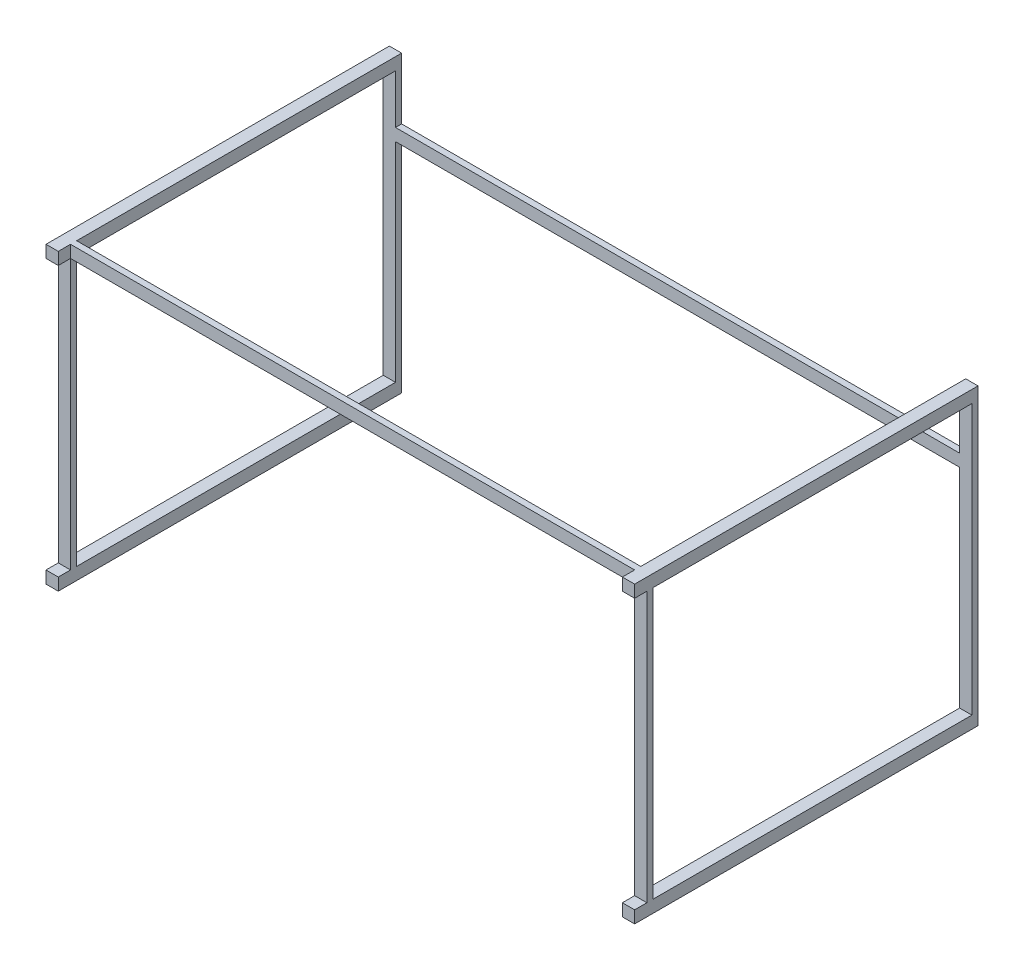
ISO-10303-21;
HEADER;
FILE_DESCRIPTION(('STEP AP214'),'2;1');
FILE_NAME('part.step','',(''),(''),'','','');
FILE_SCHEMA(('AUTOMOTIVE_DESIGN { 1 0 10303 214 1 1 1 1 }'));
ENDSEC;
DATA;
#1=APPLICATION_CONTEXT('core data for automotive mechanical design processes');
#2=APPLICATION_PROTOCOL_DEFINITION('international standard','automotive_design',2000,#1);
#3=PRODUCT_CONTEXT('',#1,'mechanical');
#4=PRODUCT('Part','Part','',(#3));
#5=PRODUCT_RELATED_PRODUCT_CATEGORY('part','',(#4));
#6=PRODUCT_DEFINITION_FORMATION('','',#4);
#7=PRODUCT_DEFINITION_CONTEXT('part definition',#1,'design');
#8=PRODUCT_DEFINITION('design','',#6,#7);
#9=PRODUCT_DEFINITION_SHAPE('','',#8);
#10=(LENGTH_UNIT() NAMED_UNIT(*) SI_UNIT(.MILLI.,.METRE.));
#11=(NAMED_UNIT(*) PLANE_ANGLE_UNIT() SI_UNIT($,.RADIAN.));
#12=(NAMED_UNIT(*) SI_UNIT($,.STERADIAN.) SOLID_ANGLE_UNIT());
#13=UNCERTAINTY_MEASURE_WITH_UNIT(LENGTH_MEASURE(1.E-05),#10,'distance_accuracy_value','');
#14=(GEOMETRIC_REPRESENTATION_CONTEXT(3) GLOBAL_UNCERTAINTY_ASSIGNED_CONTEXT((#13)) GLOBAL_UNIT_ASSIGNED_CONTEXT((#10,
#11,#12)) REPRESENTATION_CONTEXT('',''));
#15=CARTESIAN_POINT('',(0.,0.,0.));
#16=DIRECTION('',(0.,0.,1.));
#17=DIRECTION('',(1.,0.,0.));
#18=AXIS2_PLACEMENT_3D('',#15,#16,#17);
#19=CARTESIAN_POINT('',(25.4,0.,-711.2));
#20=DIRECTION('',(1.,0.,0.));
#21=DIRECTION('',(0.,0.,-1.));
#22=AXIS2_PLACEMENT_3D('',#19,#20,#21);
#23=PLANE('',#22);
#24=DIRECTION('',(0.,1.,0.));
#25=VECTOR('',#24,1.);
#26=CARTESIAN_POINT('',(25.4,0.,-711.2));
#27=LINE('',#26,#25);
#28=CARTESIAN_POINT('',(25.4,-584.2,-711.2));
#29=VERTEX_POINT('',#28);
#30=CARTESIAN_POINT('',(25.4,-127.,-711.2));
#31=VERTEX_POINT('',#30);
#32=EDGE_CURVE('E270',#29,#31,#27,.T.);
#33=ORIENTED_EDGE('',*,*,#32,.T.);
#34=DIRECTION('',(0.,0.,-1.));
#35=VECTOR('',#34,1.);
#36=CARTESIAN_POINT('',(25.4,-127.,-698.5));
#37=LINE('',#36,#35);
#38=CARTESIAN_POINT('',(25.4,-127.,-698.5));
#39=VERTEX_POINT('',#38);
#40=EDGE_CURVE('E258',#39,#31,#37,.T.);
#41=ORIENTED_EDGE('',*,*,#40,.F.);
#42=DIRECTION('',(0.,1.,0.));
#43=VECTOR('',#42,1.);
#44=CARTESIAN_POINT('',(25.4,-584.202,-698.5));
#45=LINE('',#44,#43);
#46=CARTESIAN_POINT('',(25.4,-558.8,-698.5));
#47=VERTEX_POINT('',#46);
#48=EDGE_CURVE('E268',#47,#39,#45,.T.);
#49=ORIENTED_EDGE('',*,*,#48,.F.);
#50=DIRECTION('',(0.,0.,-1.));
#51=VECTOR('',#50,1.);
#52=CARTESIAN_POINT('',(25.4,-558.8,0.));
#53=LINE('',#52,#51);
#54=CARTESIAN_POINT('',(25.4,-558.8,-38.1));
#55=VERTEX_POINT('',#54);
#56=EDGE_CURVE('E465',#55,#47,#53,.T.);
#57=ORIENTED_EDGE('',*,*,#56,.F.);
#58=DIRECTION('',(0.,1.,0.));
#59=VECTOR('',#58,1.);
#60=CARTESIAN_POINT('',(25.4,-558.8,-38.1));
#61=LINE('',#60,#59);
#62=CARTESIAN_POINT('',(25.4,0.,-38.1));
#63=VERTEX_POINT('',#62);
#64=EDGE_CURVE('E501',#55,#63,#61,.T.);
#65=ORIENTED_EDGE('',*,*,#64,.T.);
#66=DIRECTION('',(0.,0.,-1.));
#67=VECTOR('',#66,1.);
#68=CARTESIAN_POINT('',(25.4,0.,-25.4));
#69=LINE('',#68,#67);
#70=CARTESIAN_POINT('',(25.4,0.,-25.4));
#71=VERTEX_POINT('',#70);
#72=EDGE_CURVE('E419',#71,#63,#69,.T.);
#73=ORIENTED_EDGE('',*,*,#72,.F.);
#74=DIRECTION('',(0.,1.,0.));
#75=VECTOR('',#74,1.);
#76=CARTESIAN_POINT('',(25.4,-558.8,-25.4));
#77=LINE('',#76,#75);
#78=CARTESIAN_POINT('',(25.4,-558.8,-25.4));
#79=VERTEX_POINT('',#78);
#80=EDGE_CURVE('E497',#79,#71,#77,.T.);
#81=ORIENTED_EDGE('',*,*,#80,.F.);
#82=CARTESIAN_POINT('',(25.4,-558.8,0.));
#83=VERTEX_POINT('',#82);
#84=EDGE_CURVE('E466',#83,#79,#53,.T.);
#85=ORIENTED_EDGE('',*,*,#84,.F.);
#86=DIRECTION('',(0.,1.,0.));
#87=VECTOR('',#86,1.);
#88=CARTESIAN_POINT('',(25.4,-558.8,0.));
#89=LINE('',#88,#87);
#90=CARTESIAN_POINT('',(25.4,-584.2,0.));
#91=VERTEX_POINT('',#90);
#92=EDGE_CURVE('E454',#91,#83,#89,.T.);
#93=ORIENTED_EDGE('',*,*,#92,.F.);
#94=DIRECTION('',(0.,0.,-1.));
#95=VECTOR('',#94,1.);
#96=CARTESIAN_POINT('',(25.4,-584.2,0.));
#97=LINE('',#96,#95);
#98=EDGE_CURVE('E470',#91,#29,#97,.T.);
#99=ORIENTED_EDGE('',*,*,#98,.T.);
#100=EDGE_LOOP('',(#33,#41,#49,#57,#65,#73,#81,#85,#93,#99));
#101=FACE_BOUND('',#100,.T.);
#102=ADVANCED_FACE('F54',(#101),#23,.T.);
#103=CARTESIAN_POINT('',(25.4,-101.6,-698.5));
#104=VERTEX_POINT('',#103);
#105=CARTESIAN_POINT('',(25.4,0.,-698.5));
#106=VERTEX_POINT('',#105);
#107=EDGE_CURVE('E281',#104,#106,#45,.T.);
#108=ORIENTED_EDGE('',*,*,#107,.F.);
#109=DIRECTION('',(0.,0.,1.));
#110=VECTOR('',#109,1.);
#111=CARTESIAN_POINT('',(25.4,-101.6,-698.5));
#112=LINE('',#111,#110);
#113=CARTESIAN_POINT('',(25.4,-101.6,-711.2));
#114=VERTEX_POINT('',#113);
#115=EDGE_CURVE('E273',#114,#104,#112,.T.);
#116=ORIENTED_EDGE('',*,*,#115,.F.);
#117=CARTESIAN_POINT('',(25.4,25.4,-711.2));
#118=VERTEX_POINT('',#117);
#119=EDGE_CURVE('E513',#114,#118,#27,.T.);
#120=ORIENTED_EDGE('',*,*,#119,.T.);
#121=DIRECTION('',(0.,0.,1.));
#122=VECTOR('',#121,1.);
#123=CARTESIAN_POINT('',(25.4,25.4,-711.2));
#124=LINE('',#123,#122);
#125=CARTESIAN_POINT('',(25.4,25.4,-38.1));
#126=VERTEX_POINT('',#125);
#127=EDGE_CURVE('E64',#118,#126,#124,.T.);
#128=ORIENTED_EDGE('',*,*,#127,.T.);
#129=DIRECTION('',(0.,1.,0.));
#130=VECTOR('',#129,1.);
#131=CARTESIAN_POINT('',(25.4,0.,-38.1));
#132=LINE('',#131,#130);
#133=EDGE_CURVE('E423',#63,#126,#132,.T.);
#134=ORIENTED_EDGE('',*,*,#133,.F.);
#135=DIRECTION('',(0.,0.,1.));
#136=VECTOR('',#135,1.);
#137=CARTESIAN_POINT('',(25.4,0.,-711.2));
#138=LINE('',#137,#136);
#139=EDGE_CURVE('E538',#106,#63,#138,.T.);
#140=ORIENTED_EDGE('',*,*,#139,.F.);
#141=EDGE_LOOP('',(#108,#116,#120,#128,#134,#140));
#142=FACE_BOUND('',#141,.T.);
#143=ADVANCED_FACE('F637',(#142),#23,.T.);
#144=CARTESIAN_POINT('',(1193.8,0.,-711.2));
#145=DIRECTION('',(1.,0.,0.));
#146=DIRECTION('',(0.,0.,-1.));
#147=AXIS2_PLACEMENT_3D('',#144,#145,#146);
#148=PLANE('',#147);
#149=DIRECTION('',(0.,0.,-1.));
#150=VECTOR('',#149,1.);
#151=CARTESIAN_POINT('',(1193.8,-127.,-698.5));
#152=LINE('',#151,#150);
#153=CARTESIAN_POINT('',(1193.8,-127.,-698.5));
#154=VERTEX_POINT('',#153);
#155=CARTESIAN_POINT('',(1193.8,-127.,-711.2));
#156=VERTEX_POINT('',#155);
#157=EDGE_CURVE('E80',#154,#156,#152,.T.);
#158=ORIENTED_EDGE('',*,*,#157,.T.);
#159=DIRECTION('',(0.,1.,0.));
#160=VECTOR('',#159,1.);
#161=CARTESIAN_POINT('',(1193.8,0.,-711.2));
#162=LINE('',#161,#160);
#163=CARTESIAN_POINT('',(1193.8,-584.2,-711.2));
#164=VERTEX_POINT('',#163);
#165=EDGE_CURVE('E374',#164,#156,#162,.T.);
#166=ORIENTED_EDGE('',*,*,#165,.F.);
#167=DIRECTION('',(0.,0.,-1.));
#168=VECTOR('',#167,1.);
#169=CARTESIAN_POINT('',(1193.8,-584.2,0.));
#170=LINE('',#169,#168);
#171=CARTESIAN_POINT('',(1193.8,-584.2,0.));
#172=VERTEX_POINT('',#171);
#173=EDGE_CURVE('E318',#172,#164,#170,.T.);
#174=ORIENTED_EDGE('',*,*,#173,.F.);
#175=DIRECTION('',(0.,1.,0.));
#176=VECTOR('',#175,1.);
#177=CARTESIAN_POINT('',(1193.8,-558.8,0.));
#178=LINE('',#177,#176);
#179=CARTESIAN_POINT('',(1193.8,-558.8,0.));
#180=VERTEX_POINT('',#179);
#181=EDGE_CURVE('E306',#172,#180,#178,.T.);
#182=ORIENTED_EDGE('',*,*,#181,.T.);
#183=DIRECTION('',(0.,0.,-1.));
#184=VECTOR('',#183,1.);
#185=CARTESIAN_POINT('',(1193.8,-558.8,0.));
#186=LINE('',#185,#184);
#187=CARTESIAN_POINT('',(1193.8,-558.8,-25.4));
#188=VERTEX_POINT('',#187);
#189=EDGE_CURVE('E323',#180,#188,#186,.T.);
#190=ORIENTED_EDGE('',*,*,#189,.T.);
#191=DIRECTION('',(0.,1.,0.));
#192=VECTOR('',#191,1.);
#193=CARTESIAN_POINT('',(1193.8,-558.8,-25.4));
#194=LINE('',#193,#192);
#195=CARTESIAN_POINT('',(1193.8,0.,-25.4));
#196=VERTEX_POINT('',#195);
#197=EDGE_CURVE('E358',#188,#196,#194,.T.);
#198=ORIENTED_EDGE('',*,*,#197,.T.);
#199=DIRECTION('',(0.,0.,1.));
#200=VECTOR('',#199,1.);
#201=CARTESIAN_POINT('',(1193.8,0.,-25.4));
#202=LINE('',#201,#200);
#203=CARTESIAN_POINT('',(1193.8,0.,-38.1));
#204=VERTEX_POINT('',#203);
#205=EDGE_CURVE('E345',#204,#196,#202,.T.);
#206=ORIENTED_EDGE('',*,*,#205,.F.);
#207=DIRECTION('',(0.,1.,0.));
#208=VECTOR('',#207,1.);
#209=CARTESIAN_POINT('',(1193.8,-558.8,-38.1));
#210=LINE('',#209,#208);
#211=CARTESIAN_POINT('',(1193.8,-558.8,-38.1));
#212=VERTEX_POINT('',#211);
#213=EDGE_CURVE('E354',#212,#204,#210,.T.);
#214=ORIENTED_EDGE('',*,*,#213,.F.);
#215=CARTESIAN_POINT('',(1193.8,-558.8,-698.5));
#216=VERTEX_POINT('',#215);
#217=EDGE_CURVE('E322',#212,#216,#186,.T.);
#218=ORIENTED_EDGE('',*,*,#217,.T.);
#219=DIRECTION('',(0.,1.,0.));
#220=VECTOR('',#219,1.);
#221=CARTESIAN_POINT('',(1193.8,-584.202,-698.5));
#222=LINE('',#221,#220);
#223=EDGE_CURVE('E700',#216,#154,#222,.T.);
#224=ORIENTED_EDGE('',*,*,#223,.T.);
#225=EDGE_LOOP('',(#158,#166,#174,#182,#190,#198,#206,#214,#218,#224));
#226=FACE_BOUND('',#225,.T.);
#227=ADVANCED_FACE('F627',(#226),#148,.F.);
#228=DIRECTION('',(0.,0.,1.));
#229=VECTOR('',#228,1.);
#230=CARTESIAN_POINT('',(1193.8,-101.6,-698.5));
#231=LINE('',#230,#229);
#232=CARTESIAN_POINT('',(1193.8,-101.6,-711.2));
#233=VERTEX_POINT('',#232);
#234=CARTESIAN_POINT('',(1193.8,-101.6,-698.5));
#235=VERTEX_POINT('',#234);
#236=EDGE_CURVE('E711',#233,#235,#231,.T.);
#237=ORIENTED_EDGE('',*,*,#236,.T.);
#238=CARTESIAN_POINT('',(1193.8,0.,-698.5));
#239=VERTEX_POINT('',#238);
#240=EDGE_CURVE('E702',#235,#239,#222,.T.);
#241=ORIENTED_EDGE('',*,*,#240,.T.);
#242=DIRECTION('',(0.,0.,1.));
#243=VECTOR('',#242,1.);
#244=CARTESIAN_POINT('',(1193.8,0.,-711.2));
#245=LINE('',#244,#243);
#246=EDGE_CURVE('E396',#239,#204,#245,.T.);
#247=ORIENTED_EDGE('',*,*,#246,.T.);
#248=DIRECTION('',(0.,1.,0.));
#249=VECTOR('',#248,1.);
#250=CARTESIAN_POINT('',(1193.8,0.,-38.1));
#251=LINE('',#250,#249);
#252=CARTESIAN_POINT('',(1193.8,25.4,-38.1));
#253=VERTEX_POINT('',#252);
#254=EDGE_CURVE('E411',#204,#253,#251,.T.);
#255=ORIENTED_EDGE('',*,*,#254,.T.);
#256=DIRECTION('',(0.,0.,1.));
#257=VECTOR('',#256,1.);
#258=CARTESIAN_POINT('',(1193.8,25.4,-711.2));
#259=LINE('',#258,#257);
#260=CARTESIAN_POINT('',(1193.8,25.4,-711.2));
#261=VERTEX_POINT('',#260);
#262=EDGE_CURVE('E400',#261,#253,#259,.T.);
#263=ORIENTED_EDGE('',*,*,#262,.F.);
#264=EDGE_CURVE('E72',#233,#261,#162,.T.);
#265=ORIENTED_EDGE('',*,*,#264,.F.);
#266=EDGE_LOOP('',(#237,#241,#247,#255,#263,#265));
#267=FACE_BOUND('',#266,.T.);
#268=ADVANCED_FACE('F614',(#267),#148,.F.);
#269=CARTESIAN_POINT('',(0.,0.,-711.2));
#270=DIRECTION('',(0.,-1.,0.));
#271=DIRECTION('',(0.,0.,-1.));
#272=AXIS2_PLACEMENT_3D('',#269,#270,#271);
#273=PLANE('',#272);
#274=DIRECTION('',(0.,0.,1.));
#275=VECTOR('',#274,1.);
#276=CARTESIAN_POINT('',(0.,0.,-711.2));
#277=LINE('',#276,#275);
#278=CARTESIAN_POINT('',(0.,0.,-698.5));
#279=VERTEX_POINT('',#278);
#280=CARTESIAN_POINT('',(0.,0.,-38.1));
#281=VERTEX_POINT('',#280);
#282=EDGE_CURVE('E58',#279,#281,#277,.T.);
#283=ORIENTED_EDGE('',*,*,#282,.F.);
#284=DIRECTION('',(-1.,0.,0.));
#285=VECTOR('',#284,1.);
#286=CARTESIAN_POINT('',(0.,0.,-698.5));
#287=LINE('',#286,#285);
#288=EDGE_CURVE('E286',#106,#279,#287,.T.);
#289=ORIENTED_EDGE('',*,*,#288,.F.);
#290=ORIENTED_EDGE('',*,*,#139,.T.);
#291=DIRECTION('',(1.,0.,0.));
#292=VECTOR('',#291,1.);
#293=CARTESIAN_POINT('',(0.,0.,-38.1));
#294=LINE('',#293,#292);
#295=EDGE_CURVE('E477',#281,#63,#294,.T.);
#296=ORIENTED_EDGE('',*,*,#295,.F.);
#297=EDGE_LOOP('',(#283,#289,#290,#296));
#298=FACE_BOUND('',#297,.T.);
#299=ADVANCED_FACE('F651',(#298),#273,.T.);
#300=CARTESIAN_POINT('',(0.,-558.8,0.));
#301=DIRECTION('',(0.,-1.,0.));
#302=DIRECTION('',(0.,0.,-1.));
#303=AXIS2_PLACEMENT_3D('',#300,#301,#302);
#304=PLANE('',#303);
#305=DIRECTION('',(-1.,0.,0.));
#306=VECTOR('',#305,1.);
#307=CARTESIAN_POINT('',(0.,-558.8,-698.5));
#308=LINE('',#307,#306);
#309=CARTESIAN_POINT('',(0.,-558.8,-698.5));
#310=VERTEX_POINT('',#309);
#311=EDGE_CURVE('E278',#47,#310,#308,.T.);
#312=ORIENTED_EDGE('',*,*,#311,.T.);
#313=DIRECTION('',(0.,0.,-1.));
#314=VECTOR('',#313,1.);
#315=CARTESIAN_POINT('',(0.,-558.8,0.));
#316=LINE('',#315,#314);
#317=CARTESIAN_POINT('',(0.,-558.8,-38.1));
#318=VERTEX_POINT('',#317);
#319=EDGE_CURVE('E460',#318,#310,#316,.T.);
#320=ORIENTED_EDGE('',*,*,#319,.F.);
#321=DIRECTION('',(1.,0.,0.));
#322=VECTOR('',#321,1.);
#323=CARTESIAN_POINT('',(0.,-558.8,-38.1));
#324=LINE('',#323,#322);
#325=EDGE_CURVE('E478',#318,#55,#324,.T.);
#326=ORIENTED_EDGE('',*,*,#325,.T.);
#327=ORIENTED_EDGE('',*,*,#56,.T.);
#328=EDGE_LOOP('',(#312,#320,#326,#327));
#329=FACE_BOUND('',#328,.T.);
#330=ADVANCED_FACE('F654',(#329),#304,.F.);
#331=CARTESIAN_POINT('',(609.6,0.,-25.4));
#332=DIRECTION('',(0.,1.,0.));
#333=DIRECTION('',(0.,0.,1.));
#334=AXIS2_PLACEMENT_3D('',#331,#332,#333);
#335=PLANE('',#334);
#336=CARTESIAN_POINT('',(1193.8,0.,0.));
#337=VERTEX_POINT('',#336);
#338=EDGE_CURVE('E399',#196,#337,#245,.T.);
#339=ORIENTED_EDGE('',*,*,#338,.F.);
#340=DIRECTION('',(1.,0.,0.));
#341=VECTOR('',#340,1.);
#342=CARTESIAN_POINT('',(1219.2,0.,-25.4));
#343=LINE('',#342,#341);
#344=CARTESIAN_POINT('',(1219.2,0.,-25.4));
#345=VERTEX_POINT('',#344);
#346=EDGE_CURVE('E331',#196,#345,#343,.T.);
#347=ORIENTED_EDGE('',*,*,#346,.T.);
#348=DIRECTION('',(0.,0.,1.));
#349=VECTOR('',#348,1.);
#350=CARTESIAN_POINT('',(1219.2,0.,-711.2));
#351=LINE('',#350,#349);
#352=CARTESIAN_POINT('',(1219.2,0.,0.));
#353=VERTEX_POINT('',#352);
#354=EDGE_CURVE('E395',#345,#353,#351,.T.);
#355=ORIENTED_EDGE('',*,*,#354,.T.);
#356=DIRECTION('',(-1.,0.,0.));
#357=VECTOR('',#356,1.);
#358=CARTESIAN_POINT('',(1219.2,0.,0.));
#359=LINE('',#358,#357);
#360=EDGE_CURVE('E371',#353,#337,#359,.T.);
#361=ORIENTED_EDGE('',*,*,#360,.T.);
#362=EDGE_LOOP('',(#339,#347,#355,#361));
#363=FACE_BOUND('',#362,.T.);
#364=ADVANCED_FACE('F656',(#363),#335,.F.);
#365=DIRECTION('',(-1.,0.,0.));
#366=VECTOR('',#365,1.);
#367=CARTESIAN_POINT('',(609.6,0.,-38.1));
#368=LINE('',#367,#366);
#369=EDGE_CURVE('E435',#204,#63,#368,.T.);
#370=ORIENTED_EDGE('',*,*,#369,.F.);
#371=ORIENTED_EDGE('',*,*,#205,.T.);
#372=DIRECTION('',(-1.,0.,0.));
#373=VECTOR('',#372,1.);
#374=CARTESIAN_POINT('',(609.6,0.,-25.4));
#375=LINE('',#374,#373);
#376=EDGE_CURVE('E439',#196,#71,#375,.T.);
#377=ORIENTED_EDGE('',*,*,#376,.T.);
#378=ORIENTED_EDGE('',*,*,#72,.T.);
#379=EDGE_LOOP('',(#370,#371,#377,#378));
#380=FACE_BOUND('',#379,.T.);
#381=ADVANCED_FACE('F631',(#380),#335,.F.);
#382=DIRECTION('',(0.,-1.,0.));
#383=VECTOR('',#382,1.);
#384=CARTESIAN_POINT('',(25.4,0.,-25.4));
#385=LINE('',#384,#383);
#386=CARTESIAN_POINT('',(25.4,25.4,-25.4));
#387=VERTEX_POINT('',#386);
#388=EDGE_CURVE('E415',#387,#71,#385,.T.);
#389=ORIENTED_EDGE('',*,*,#388,.F.);
#390=CARTESIAN_POINT('',(25.4,25.4,0.));
#391=VERTEX_POINT('',#390);
#392=EDGE_CURVE('E537',#387,#391,#124,.T.);
#393=ORIENTED_EDGE('',*,*,#392,.T.);
#394=DIRECTION('',(0.,1.,0.));
#395=VECTOR('',#394,1.);
#396=CARTESIAN_POINT('',(25.4,0.,0.));
#397=LINE('',#396,#395);
#398=CARTESIAN_POINT('',(25.4,0.,0.));
#399=VERTEX_POINT('',#398);
#400=EDGE_CURVE('E529',#399,#391,#397,.T.);
#401=ORIENTED_EDGE('',*,*,#400,.F.);
#402=EDGE_CURVE('E540',#71,#399,#138,.T.);
#403=ORIENTED_EDGE('',*,*,#402,.F.);
#404=EDGE_LOOP('',(#389,#393,#401,#403));
#405=FACE_BOUND('',#404,.T.);
#406=ADVANCED_FACE('F589',(#405),#23,.T.);
#407=DIRECTION('',(-1.,0.,0.));
#408=VECTOR('',#407,1.);
#409=CARTESIAN_POINT('',(0.,0.,-25.4));
#410=LINE('',#409,#408);
#411=CARTESIAN_POINT('',(0.,0.,-25.4));
#412=VERTEX_POINT('',#411);
#413=EDGE_CURVE('E483',#71,#412,#410,.T.);
#414=ORIENTED_EDGE('',*,*,#413,.F.);
#415=ORIENTED_EDGE('',*,*,#402,.T.);
#416=DIRECTION('',(1.,0.,0.));
#417=VECTOR('',#416,1.);
#418=CARTESIAN_POINT('',(0.,0.,0.));
#419=LINE('',#418,#417);
#420=CARTESIAN_POINT('',(0.,0.,0.));
#421=VERTEX_POINT('',#420);
#422=EDGE_CURVE('E525',#421,#399,#419,.T.);
#423=ORIENTED_EDGE('',*,*,#422,.F.);
#424=EDGE_CURVE('E521',#412,#421,#277,.T.);
#425=ORIENTED_EDGE('',*,*,#424,.F.);
#426=EDGE_LOOP('',(#414,#415,#423,#425));
#427=FACE_BOUND('',#426,.T.);
#428=ADVANCED_FACE('F558',(#427),#273,.T.);
#429=CARTESIAN_POINT('',(0.,0.,-711.2));
#430=DIRECTION('',(-1.,0.,0.));
#431=DIRECTION('',(0.,0.,1.));
#432=AXIS2_PLACEMENT_3D('',#429,#430,#431);
#433=PLANE('',#432);
#434=DIRECTION('',(0.,1.,0.));
#435=VECTOR('',#434,1.);
#436=CARTESIAN_POINT('',(0.,-584.202,-698.5));
#437=LINE('',#436,#435);
#438=EDGE_CURVE('E280',#310,#279,#437,.T.);
#439=ORIENTED_EDGE('',*,*,#438,.T.);
#440=ORIENTED_EDGE('',*,*,#282,.T.);
#441=DIRECTION('',(0.,1.,0.));
#442=VECTOR('',#441,1.);
#443=CARTESIAN_POINT('',(0.,-558.8,-38.1));
#444=LINE('',#443,#442);
#445=EDGE_CURVE('E505',#318,#281,#444,.T.);
#446=ORIENTED_EDGE('',*,*,#445,.F.);
#447=ORIENTED_EDGE('',*,*,#319,.T.);
#448=EDGE_LOOP('',(#439,#440,#446,#447));
#449=FACE_BOUND('',#448,.T.);
#450=DIRECTION('',(0.,-1.,0.));
#451=VECTOR('',#450,1.);
#452=CARTESIAN_POINT('',(0.,0.,0.));
#453=LINE('',#452,#451);
#454=CARTESIAN_POINT('',(0.,25.4,0.));
#455=VERTEX_POINT('',#454);
#456=EDGE_CURVE('E509',#455,#421,#453,.T.);
#457=ORIENTED_EDGE('',*,*,#456,.F.);
#458=DIRECTION('',(0.,0.,1.));
#459=VECTOR('',#458,1.);
#460=CARTESIAN_POINT('',(0.,25.4,-711.2));
#461=LINE('',#460,#459);
#462=CARTESIAN_POINT('',(0.,25.4,-711.2));
#463=VERTEX_POINT('',#462);
#464=EDGE_CURVE('E12',#463,#455,#461,.T.);
#465=ORIENTED_EDGE('',*,*,#464,.F.);
#466=DIRECTION('',(0.,-1.,0.));
#467=VECTOR('',#466,1.);
#468=CARTESIAN_POINT('',(0.,0.,-711.2));
#469=LINE('',#468,#467);
#470=CARTESIAN_POINT('',(0.,-584.2,-711.2));
#471=VERTEX_POINT('',#470);
#472=EDGE_CURVE('E510',#463,#471,#469,.T.);
#473=ORIENTED_EDGE('',*,*,#472,.T.);
#474=DIRECTION('',(0.,0.,-1.));
#475=VECTOR('',#474,1.);
#476=CARTESIAN_POINT('',(0.,-584.2,0.));
#477=LINE('',#476,#475);
#478=CARTESIAN_POINT('',(0.,-584.2,0.));
#479=VERTEX_POINT('',#478);
#480=EDGE_CURVE('E473',#479,#471,#477,.T.);
#481=ORIENTED_EDGE('',*,*,#480,.F.);
#482=DIRECTION('',(0.,-1.,0.));
#483=VECTOR('',#482,1.);
#484=CARTESIAN_POINT('',(0.,-558.8,0.));
#485=LINE('',#484,#483);
#486=CARTESIAN_POINT('',(0.,-558.8,0.));
#487=VERTEX_POINT('',#486);
#488=EDGE_CURVE('E447',#487,#479,#485,.T.);
#489=ORIENTED_EDGE('',*,*,#488,.F.);
#490=CARTESIAN_POINT('',(0.,-558.8,-25.4));
#491=VERTEX_POINT('',#490);
#492=EDGE_CURVE('E461',#487,#491,#316,.T.);
#493=ORIENTED_EDGE('',*,*,#492,.T.);
#494=DIRECTION('',(0.,1.,0.));
#495=VECTOR('',#494,1.);
#496=CARTESIAN_POINT('',(0.,-558.8,-25.4));
#497=LINE('',#496,#495);
#498=EDGE_CURVE('E487',#491,#412,#497,.T.);
#499=ORIENTED_EDGE('',*,*,#498,.T.);
#500=ORIENTED_EDGE('',*,*,#424,.T.);
#501=EDGE_LOOP('',(#457,#465,#473,#481,#489,#493,#499,#500));
#502=FACE_BOUND('',#501,.T.);
#503=ADVANCED_FACE('F56',(#449,#502),#433,.T.);
#504=CARTESIAN_POINT('',(0.,25.4,-711.2));
#505=DIRECTION('',(0.,1.,0.));
#506=DIRECTION('',(0.,0.,1.));
#507=AXIS2_PLACEMENT_3D('',#504,#505,#506);
#508=PLANE('',#507);
#509=DIRECTION('',(-1.,0.,0.));
#510=VECTOR('',#509,1.);
#511=CARTESIAN_POINT('',(0.,25.4,0.));
#512=LINE('',#511,#510);
#513=EDGE_CURVE('E514',#391,#455,#512,.T.);
#514=ORIENTED_EDGE('',*,*,#513,.F.);
#515=ORIENTED_EDGE('',*,*,#392,.F.);
#516=DIRECTION('',(-1.,0.,0.));
#517=VECTOR('',#516,1.);
#518=CARTESIAN_POINT('',(609.6,25.4,-25.4));
#519=LINE('',#518,#517);
#520=CARTESIAN_POINT('',(1193.8,25.4,-25.4));
#521=VERTEX_POINT('',#520);
#522=EDGE_CURVE('E427',#521,#387,#519,.T.);
#523=ORIENTED_EDGE('',*,*,#522,.F.);
#524=CARTESIAN_POINT('',(1193.8,25.4,0.));
#525=VERTEX_POINT('',#524);
#526=EDGE_CURVE('E404',#521,#525,#259,.T.);
#527=ORIENTED_EDGE('',*,*,#526,.T.);
#528=DIRECTION('',(1.,0.,0.));
#529=VECTOR('',#528,1.);
#530=CARTESIAN_POINT('',(1219.2,25.4,0.));
#531=LINE('',#530,#529);
#532=CARTESIAN_POINT('',(1219.2,25.4,0.));
#533=VERTEX_POINT('',#532);
#534=EDGE_CURVE('E381',#525,#533,#531,.T.);
#535=ORIENTED_EDGE('',*,*,#534,.T.);
#536=DIRECTION('',(0.,0.,1.));
#537=VECTOR('',#536,1.);
#538=CARTESIAN_POINT('',(1219.2,25.4,-711.2));
#539=LINE('',#538,#537);
#540=CARTESIAN_POINT('',(1219.2,25.4,-711.2));
#541=VERTEX_POINT('',#540);
#542=EDGE_CURVE('E377',#541,#533,#539,.T.);
#543=ORIENTED_EDGE('',*,*,#542,.F.);
#544=DIRECTION('',(1.,0.,0.));
#545=VECTOR('',#544,1.);
#546=CARTESIAN_POINT('',(1219.2,25.4,-711.2));
#547=LINE('',#546,#545);
#548=EDGE_CURVE('E370',#261,#541,#547,.T.);
#549=ORIENTED_EDGE('',*,*,#548,.F.);
#550=ORIENTED_EDGE('',*,*,#262,.T.);
#551=DIRECTION('',(-1.,0.,0.));
#552=VECTOR('',#551,1.);
#553=CARTESIAN_POINT('',(609.6,25.4,-38.1));
#554=LINE('',#553,#552);
#555=EDGE_CURVE('E431',#253,#126,#554,.T.);
#556=ORIENTED_EDGE('',*,*,#555,.T.);
#557=ORIENTED_EDGE('',*,*,#127,.F.);
#558=DIRECTION('',(-1.,0.,0.));
#559=VECTOR('',#558,1.);
#560=CARTESIAN_POINT('',(0.,25.4,-711.2));
#561=LINE('',#560,#559);
#562=EDGE_CURVE('E517',#118,#463,#561,.T.);
#563=ORIENTED_EDGE('',*,*,#562,.T.);
#564=ORIENTED_EDGE('',*,*,#464,.T.);
#565=EDGE_LOOP('',(#514,#515,#523,#527,#535,#543,#549,#550,#556,#557,#563,#564));
#566=FACE_BOUND('',#565,.T.);
#567=ADVANCED_FACE('F564',(#566),#508,.T.);
#568=CARTESIAN_POINT('',(0.,0.,-711.2));
#569=DIRECTION('',(0.,0.,-1.));
#570=DIRECTION('',(-1.,0.,0.));
#571=AXIS2_PLACEMENT_3D('',#568,#569,#570);
#572=PLANE('',#571);
#573=ORIENTED_EDGE('',*,*,#472,.F.);
#574=ORIENTED_EDGE('',*,*,#562,.F.);
#575=ORIENTED_EDGE('',*,*,#119,.F.);
#576=DIRECTION('',(-1.,0.,0.));
#577=VECTOR('',#576,1.);
#578=CARTESIAN_POINT('',(1219.202,-101.6,-711.2));
#579=LINE('',#578,#577);
#580=EDGE_CURVE('E612',#233,#114,#579,.T.);
#581=ORIENTED_EDGE('',*,*,#580,.F.);
#582=ORIENTED_EDGE('',*,*,#264,.T.);
#583=ORIENTED_EDGE('',*,*,#548,.T.);
#584=DIRECTION('',(0.,-1.,0.));
#585=VECTOR('',#584,1.);
#586=CARTESIAN_POINT('',(1219.2,0.,-711.2));
#587=LINE('',#586,#585);
#588=CARTESIAN_POINT('',(1219.2,-584.2,-711.2));
#589=VERTEX_POINT('',#588);
#590=EDGE_CURVE('E367',#541,#589,#587,.T.);
#591=ORIENTED_EDGE('',*,*,#590,.T.);
#592=DIRECTION('',(-1.,0.,0.));
#593=VECTOR('',#592,1.);
#594=CARTESIAN_POINT('',(1219.2,-584.2,-711.2));
#595=LINE('',#594,#593);
#596=EDGE_CURVE('E294',#589,#164,#595,.T.);
#597=ORIENTED_EDGE('',*,*,#596,.T.);
#598=ORIENTED_EDGE('',*,*,#165,.T.);
#599=DIRECTION('',(-1.,0.,0.));
#600=VECTOR('',#599,1.);
#601=CARTESIAN_POINT('',(1219.202,-127.,-711.2));
#602=LINE('',#601,#600);
#603=EDGE_CURVE('E263',#156,#31,#602,.T.);
#604=ORIENTED_EDGE('',*,*,#603,.T.);
#605=ORIENTED_EDGE('',*,*,#32,.F.);
#606=DIRECTION('',(1.,0.,0.));
#607=VECTOR('',#606,1.);
#608=CARTESIAN_POINT('',(0.,-584.2,-711.2));
#609=LINE('',#608,#607);
#610=EDGE_CURVE('E443',#471,#29,#609,.T.);
#611=ORIENTED_EDGE('',*,*,#610,.F.);
#612=EDGE_LOOP('',(#573,#574,#575,#581,#582,#583,#591,#597,#598,#604,#605,#611));
#613=FACE_BOUND('',#612,.T.);
#614=ADVANCED_FACE('F571',(#613),#572,.T.);
#615=CARTESIAN_POINT('',(0.,0.,0.));
#616=DIRECTION('',(0.,0.,-1.));
#617=DIRECTION('',(-1.,0.,0.));
#618=AXIS2_PLACEMENT_3D('',#615,#616,#617);
#619=PLANE('',#618);
#620=ORIENTED_EDGE('',*,*,#456,.T.);
#621=ORIENTED_EDGE('',*,*,#422,.T.);
#622=ORIENTED_EDGE('',*,*,#400,.T.);
#623=ORIENTED_EDGE('',*,*,#513,.T.);
#624=EDGE_LOOP('',(#620,#621,#622,#623));
#625=FACE_BOUND('',#624,.T.);
#626=ADVANCED_FACE('F560',(#625),#619,.F.);
#627=CARTESIAN_POINT('',(0.,-558.8,-38.1));
#628=DIRECTION('',(0.,0.,1.));
#629=DIRECTION('',(1.,0.,0.));
#630=AXIS2_PLACEMENT_3D('',#627,#628,#629);
#631=PLANE('',#630);
#632=ORIENTED_EDGE('',*,*,#295,.T.);
#633=ORIENTED_EDGE('',*,*,#64,.F.);
#634=ORIENTED_EDGE('',*,*,#325,.F.);
#635=ORIENTED_EDGE('',*,*,#445,.T.);
#636=EDGE_LOOP('',(#632,#633,#634,#635));
#637=FACE_BOUND('',#636,.T.);
#638=ADVANCED_FACE('F634',(#637),#631,.F.);
#639=CARTESIAN_POINT('',(0.,-558.8,-25.4));
#640=DIRECTION('',(0.,0.,-1.));
#641=DIRECTION('',(-1.,0.,0.));
#642=AXIS2_PLACEMENT_3D('',#639,#640,#641);
#643=PLANE('',#642);
#644=ORIENTED_EDGE('',*,*,#413,.T.);
#645=ORIENTED_EDGE('',*,*,#498,.F.);
#646=DIRECTION('',(-1.,0.,0.));
#647=VECTOR('',#646,1.);
#648=CARTESIAN_POINT('',(0.,-558.8,-25.4));
#649=LINE('',#648,#647);
#650=EDGE_CURVE('E482',#79,#491,#649,.T.);
#651=ORIENTED_EDGE('',*,*,#650,.F.);
#652=ORIENTED_EDGE('',*,*,#80,.T.);
#653=EDGE_LOOP('',(#644,#645,#651,#652));
#654=FACE_BOUND('',#653,.T.);
#655=ADVANCED_FACE('F587',(#654),#643,.F.);
#656=ORIENTED_EDGE('',*,*,#84,.T.);
#657=ORIENTED_EDGE('',*,*,#650,.T.);
#658=ORIENTED_EDGE('',*,*,#492,.F.);
#659=DIRECTION('',(-1.,0.,0.));
#660=VECTOR('',#659,1.);
#661=CARTESIAN_POINT('',(0.,-558.8,0.));
#662=LINE('',#661,#660);
#663=EDGE_CURVE('E457',#83,#487,#662,.T.);
#664=ORIENTED_EDGE('',*,*,#663,.F.);
#665=EDGE_LOOP('',(#656,#657,#658,#664));
#666=FACE_BOUND('',#665,.T.);
#667=ADVANCED_FACE('F584',(#666),#304,.F.);
#668=CARTESIAN_POINT('',(0.,-584.2,0.));
#669=DIRECTION('',(0.,1.,0.));
#670=DIRECTION('',(0.,0.,1.));
#671=AXIS2_PLACEMENT_3D('',#668,#669,#670);
#672=PLANE('',#671);
#673=ORIENTED_EDGE('',*,*,#480,.T.);
#674=ORIENTED_EDGE('',*,*,#610,.T.);
#675=ORIENTED_EDGE('',*,*,#98,.F.);
#676=DIRECTION('',(1.,0.,0.));
#677=VECTOR('',#676,1.);
#678=CARTESIAN_POINT('',(0.,-584.2,0.));
#679=LINE('',#678,#677);
#680=EDGE_CURVE('E451',#479,#91,#679,.T.);
#681=ORIENTED_EDGE('',*,*,#680,.F.);
#682=EDGE_LOOP('',(#673,#674,#675,#681));
#683=FACE_BOUND('',#682,.T.);
#684=ADVANCED_FACE('F575',(#683),#672,.F.);
#685=CARTESIAN_POINT('',(0.,0.,0.));
#686=DIRECTION('',(0.,0.,1.));
#687=DIRECTION('',(1.,0.,0.));
#688=AXIS2_PLACEMENT_3D('',#685,#686,#687);
#689=PLANE('',#688);
#690=ORIENTED_EDGE('',*,*,#488,.T.);
#691=ORIENTED_EDGE('',*,*,#680,.T.);
#692=ORIENTED_EDGE('',*,*,#92,.T.);
#693=ORIENTED_EDGE('',*,*,#663,.T.);
#694=EDGE_LOOP('',(#690,#691,#692,#693));
#695=FACE_BOUND('',#694,.T.);
#696=ADVANCED_FACE('F580',(#695),#689,.T.);
#697=CARTESIAN_POINT('',(609.6,0.,-25.4));
#698=DIRECTION('',(0.,0.,-1.));
#699=DIRECTION('',(-1.,0.,0.));
#700=AXIS2_PLACEMENT_3D('',#697,#698,#699);
#701=PLANE('',#700);
#702=ORIENTED_EDGE('',*,*,#388,.T.);
#703=ORIENTED_EDGE('',*,*,#376,.F.);
#704=DIRECTION('',(0.,-1.,0.));
#705=VECTOR('',#704,1.);
#706=CARTESIAN_POINT('',(1193.8,0.,-25.4));
#707=LINE('',#706,#705);
#708=EDGE_CURVE('E394',#521,#196,#707,.T.);
#709=ORIENTED_EDGE('',*,*,#708,.F.);
#710=ORIENTED_EDGE('',*,*,#522,.T.);
#711=EDGE_LOOP('',(#702,#703,#709,#710));
#712=FACE_BOUND('',#711,.T.);
#713=ADVANCED_FACE('F592',(#712),#701,.F.);
#714=ORIENTED_EDGE('',*,*,#246,.F.);
#715=DIRECTION('',(1.,0.,0.));
#716=VECTOR('',#715,1.);
#717=CARTESIAN_POINT('',(1219.2,0.,-698.5));
#718=LINE('',#717,#716);
#719=CARTESIAN_POINT('',(1219.2,0.,-698.5));
#720=VERTEX_POINT('',#719);
#721=EDGE_CURVE('E691',#239,#720,#718,.T.);
#722=ORIENTED_EDGE('',*,*,#721,.T.);
#723=CARTESIAN_POINT('',(1219.2,0.,-38.1));
#724=VERTEX_POINT('',#723);
#725=EDGE_CURVE('E391',#720,#724,#351,.T.);
#726=ORIENTED_EDGE('',*,*,#725,.T.);
#727=DIRECTION('',(-1.,0.,0.));
#728=VECTOR('',#727,1.);
#729=CARTESIAN_POINT('',(1219.2,0.,-38.1));
#730=LINE('',#729,#728);
#731=EDGE_CURVE('E337',#724,#204,#730,.T.);
#732=ORIENTED_EDGE('',*,*,#731,.T.);
#733=EDGE_LOOP('',(#714,#722,#726,#732));
#734=FACE_BOUND('',#733,.T.);
#735=ADVANCED_FACE('F664',(#734),#335,.F.);
#736=CARTESIAN_POINT('',(609.6,0.,-38.1));
#737=DIRECTION('',(0.,0.,1.));
#738=DIRECTION('',(0.,-1.,0.));
#739=AXIS2_PLACEMENT_3D('',#736,#737,#738);
#740=PLANE('',#739);
#741=ORIENTED_EDGE('',*,*,#133,.T.);
#742=ORIENTED_EDGE('',*,*,#555,.F.);
#743=ORIENTED_EDGE('',*,*,#254,.F.);
#744=ORIENTED_EDGE('',*,*,#369,.T.);
#745=EDGE_LOOP('',(#741,#742,#743,#744));
#746=FACE_BOUND('',#745,.T.);
#747=ADVANCED_FACE('F618',(#746),#740,.F.);
#748=ORIENTED_EDGE('',*,*,#526,.F.);
#749=ORIENTED_EDGE('',*,*,#708,.T.);
#750=ORIENTED_EDGE('',*,*,#338,.T.);
#751=DIRECTION('',(0.,1.,0.));
#752=VECTOR('',#751,1.);
#753=CARTESIAN_POINT('',(1193.8,0.,0.));
#754=LINE('',#753,#752);
#755=EDGE_CURVE('E384',#337,#525,#754,.T.);
#756=ORIENTED_EDGE('',*,*,#755,.T.);
#757=EDGE_LOOP('',(#748,#749,#750,#756));
#758=FACE_BOUND('',#757,.T.);
#759=ADVANCED_FACE('F600',(#758),#148,.F.);
#760=CARTESIAN_POINT('',(1219.2,0.,-711.2));
#761=DIRECTION('',(-1.,0.,0.));
#762=DIRECTION('',(0.,0.,1.));
#763=AXIS2_PLACEMENT_3D('',#760,#761,#762);
#764=PLANE('',#763);
#765=ORIENTED_EDGE('',*,*,#725,.F.);
#766=DIRECTION('',(0.,1.,0.));
#767=VECTOR('',#766,1.);
#768=CARTESIAN_POINT('',(1219.2,-584.202,-698.5));
#769=LINE('',#768,#767);
#770=CARTESIAN_POINT('',(1219.2,-558.8,-698.5));
#771=VERTEX_POINT('',#770);
#772=EDGE_CURVE('E696',#771,#720,#769,.T.);
#773=ORIENTED_EDGE('',*,*,#772,.F.);
#774=DIRECTION('',(0.,0.,-1.));
#775=VECTOR('',#774,1.);
#776=CARTESIAN_POINT('',(1219.2,-558.8,0.));
#777=LINE('',#776,#775);
#778=CARTESIAN_POINT('',(1219.2,-558.8,-38.1));
#779=VERTEX_POINT('',#778);
#780=EDGE_CURVE('E327',#779,#771,#777,.T.);
#781=ORIENTED_EDGE('',*,*,#780,.F.);
#782=DIRECTION('',(0.,1.,0.));
#783=VECTOR('',#782,1.);
#784=CARTESIAN_POINT('',(1219.2,-558.8,-38.1));
#785=LINE('',#784,#783);
#786=EDGE_CURVE('E341',#779,#724,#785,.T.);
#787=ORIENTED_EDGE('',*,*,#786,.T.);
#788=EDGE_LOOP('',(#765,#773,#781,#787));
#789=FACE_BOUND('',#788,.T.);
#790=DIRECTION('',(0.,-1.,0.));
#791=VECTOR('',#790,1.);
#792=CARTESIAN_POINT('',(1219.2,0.,0.));
#793=LINE('',#792,#791);
#794=EDGE_CURVE('E366',#533,#353,#793,.T.);
#795=ORIENTED_EDGE('',*,*,#794,.T.);
#796=ORIENTED_EDGE('',*,*,#354,.F.);
#797=DIRECTION('',(0.,1.,0.));
#798=VECTOR('',#797,1.);
#799=CARTESIAN_POINT('',(1219.2,-558.8,-25.4));
#800=LINE('',#799,#798);
#801=CARTESIAN_POINT('',(1219.2,-558.8,-25.4));
#802=VERTEX_POINT('',#801);
#803=EDGE_CURVE('E362',#802,#345,#800,.T.);
#804=ORIENTED_EDGE('',*,*,#803,.F.);
#805=CARTESIAN_POINT('',(1219.2,-558.8,0.));
#806=VERTEX_POINT('',#805);
#807=EDGE_CURVE('E328',#806,#802,#777,.T.);
#808=ORIENTED_EDGE('',*,*,#807,.F.);
#809=DIRECTION('',(0.,-1.,0.));
#810=VECTOR('',#809,1.);
#811=CARTESIAN_POINT('',(1219.2,-558.8,0.));
#812=LINE('',#811,#810);
#813=CARTESIAN_POINT('',(1219.2,-584.2,0.));
#814=VERTEX_POINT('',#813);
#815=EDGE_CURVE('E298',#806,#814,#812,.T.);
#816=ORIENTED_EDGE('',*,*,#815,.T.);
#817=DIRECTION('',(0.,0.,-1.));
#818=VECTOR('',#817,1.);
#819=CARTESIAN_POINT('',(1219.2,-584.2,0.));
#820=LINE('',#819,#818);
#821=EDGE_CURVE('E314',#814,#589,#820,.T.);
#822=ORIENTED_EDGE('',*,*,#821,.T.);
#823=ORIENTED_EDGE('',*,*,#590,.F.);
#824=ORIENTED_EDGE('',*,*,#542,.T.);
#825=EDGE_LOOP('',(#795,#796,#804,#808,#816,#822,#823,#824));
#826=FACE_BOUND('',#825,.T.);
#827=ADVANCED_FACE('F607',(#789,#826),#764,.F.);
#828=CARTESIAN_POINT('',(1219.2,0.,0.));
#829=DIRECTION('',(0.,0.,-1.));
#830=DIRECTION('',(1.,0.,0.));
#831=AXIS2_PLACEMENT_3D('',#828,#829,#830);
#832=PLANE('',#831);
#833=ORIENTED_EDGE('',*,*,#794,.F.);
#834=ORIENTED_EDGE('',*,*,#534,.F.);
#835=ORIENTED_EDGE('',*,*,#755,.F.);
#836=ORIENTED_EDGE('',*,*,#360,.F.);
#837=EDGE_LOOP('',(#833,#834,#835,#836));
#838=FACE_BOUND('',#837,.T.);
#839=ADVANCED_FACE('F605',(#838),#832,.F.);
#840=CARTESIAN_POINT('',(1219.2,-558.8,-25.4));
#841=DIRECTION('',(0.,0.,1.));
#842=DIRECTION('',(1.,0.,0.));
#843=AXIS2_PLACEMENT_3D('',#840,#841,#842);
#844=PLANE('',#843);
#845=ORIENTED_EDGE('',*,*,#346,.F.);
#846=ORIENTED_EDGE('',*,*,#197,.F.);
#847=DIRECTION('',(1.,0.,0.));
#848=VECTOR('',#847,1.);
#849=CARTESIAN_POINT('',(1219.2,-558.8,-25.4));
#850=LINE('',#849,#848);
#851=EDGE_CURVE('E332',#188,#802,#850,.T.);
#852=ORIENTED_EDGE('',*,*,#851,.T.);
#853=ORIENTED_EDGE('',*,*,#803,.T.);
#854=EDGE_LOOP('',(#845,#846,#852,#853));
#855=FACE_BOUND('',#854,.T.);
#856=ADVANCED_FACE('F751',(#855),#844,.T.);
#857=CARTESIAN_POINT('',(1219.2,-558.8,-38.1));
#858=DIRECTION('',(0.,0.,-1.));
#859=DIRECTION('',(-1.,0.,0.));
#860=AXIS2_PLACEMENT_3D('',#857,#858,#859);
#861=PLANE('',#860);
#862=ORIENTED_EDGE('',*,*,#731,.F.);
#863=ORIENTED_EDGE('',*,*,#786,.F.);
#864=DIRECTION('',(-1.,0.,0.));
#865=VECTOR('',#864,1.);
#866=CARTESIAN_POINT('',(1219.2,-558.8,-38.1));
#867=LINE('',#866,#865);
#868=EDGE_CURVE('E336',#779,#212,#867,.T.);
#869=ORIENTED_EDGE('',*,*,#868,.T.);
#870=ORIENTED_EDGE('',*,*,#213,.T.);
#871=EDGE_LOOP('',(#862,#863,#869,#870));
#872=FACE_BOUND('',#871,.T.);
#873=ADVANCED_FACE('F624',(#872),#861,.T.);
#874=CARTESIAN_POINT('',(1219.2,-558.8,0.));
#875=DIRECTION('',(0.,1.,0.));
#876=DIRECTION('',(0.,0.,1.));
#877=AXIS2_PLACEMENT_3D('',#874,#875,#876);
#878=PLANE('',#877);
#879=ORIENTED_EDGE('',*,*,#851,.F.);
#880=ORIENTED_EDGE('',*,*,#189,.F.);
#881=DIRECTION('',(1.,0.,0.));
#882=VECTOR('',#881,1.);
#883=CARTESIAN_POINT('',(1219.2,-558.8,0.));
#884=LINE('',#883,#882);
#885=EDGE_CURVE('E302',#180,#806,#884,.T.);
#886=ORIENTED_EDGE('',*,*,#885,.T.);
#887=ORIENTED_EDGE('',*,*,#807,.T.);
#888=EDGE_LOOP('',(#879,#880,#886,#887));
#889=FACE_BOUND('',#888,.T.);
#890=ADVANCED_FACE('F745',(#889),#878,.T.);
#891=DIRECTION('',(-1.,0.,0.));
#892=VECTOR('',#891,1.);
#893=CARTESIAN_POINT('',(1219.2,-558.8,-698.5));
#894=LINE('',#893,#892);
#895=EDGE_CURVE('E293',#771,#216,#894,.T.);
#896=ORIENTED_EDGE('',*,*,#895,.T.);
#897=ORIENTED_EDGE('',*,*,#217,.F.);
#898=ORIENTED_EDGE('',*,*,#868,.F.);
#899=ORIENTED_EDGE('',*,*,#780,.T.);
#900=EDGE_LOOP('',(#896,#897,#898,#899));
#901=FACE_BOUND('',#900,.T.);
#902=ADVANCED_FACE('F699',(#901),#878,.T.);
#903=CARTESIAN_POINT('',(1219.2,-584.2,0.));
#904=DIRECTION('',(0.,-1.,0.));
#905=DIRECTION('',(0.,0.,-1.));
#906=AXIS2_PLACEMENT_3D('',#903,#904,#905);
#907=PLANE('',#906);
#908=ORIENTED_EDGE('',*,*,#173,.T.);
#909=ORIENTED_EDGE('',*,*,#596,.F.);
#910=ORIENTED_EDGE('',*,*,#821,.F.);
#911=DIRECTION('',(-1.,0.,0.));
#912=VECTOR('',#911,1.);
#913=CARTESIAN_POINT('',(1219.2,-584.2,0.));
#914=LINE('',#913,#912);
#915=EDGE_CURVE('E310',#814,#172,#914,.T.);
#916=ORIENTED_EDGE('',*,*,#915,.T.);
#917=EDGE_LOOP('',(#908,#909,#910,#916));
#918=FACE_BOUND('',#917,.T.);
#919=ADVANCED_FACE('F738',(#918),#907,.T.);
#920=CARTESIAN_POINT('',(1219.2,0.,0.));
#921=DIRECTION('',(0.,0.,1.));
#922=DIRECTION('',(-1.,0.,0.));
#923=AXIS2_PLACEMENT_3D('',#920,#921,#922);
#924=PLANE('',#923);
#925=ORIENTED_EDGE('',*,*,#815,.F.);
#926=ORIENTED_EDGE('',*,*,#885,.F.);
#927=ORIENTED_EDGE('',*,*,#181,.F.);
#928=ORIENTED_EDGE('',*,*,#915,.F.);
#929=EDGE_LOOP('',(#925,#926,#927,#928));
#930=FACE_BOUND('',#929,.T.);
#931=ADVANCED_FACE('F734',(#930),#924,.T.);
#932=CARTESIAN_POINT('',(0.,-584.202,-698.5));
#933=DIRECTION('',(0.,0.,-1.));
#934=DIRECTION('',(-1.,0.,0.));
#935=AXIS2_PLACEMENT_3D('',#932,#933,#934);
#936=PLANE('',#935);
#937=ORIENTED_EDGE('',*,*,#311,.F.);
#938=ORIENTED_EDGE('',*,*,#48,.T.);
#939=DIRECTION('',(-1.,0.,0.));
#940=VECTOR('',#939,1.);
#941=CARTESIAN_POINT('',(1219.202,-127.,-698.5));
#942=LINE('',#941,#940);
#943=EDGE_CURVE('E254',#154,#39,#942,.T.);
#944=ORIENTED_EDGE('',*,*,#943,.F.);
#945=ORIENTED_EDGE('',*,*,#223,.F.);
#946=ORIENTED_EDGE('',*,*,#895,.F.);
#947=ORIENTED_EDGE('',*,*,#772,.T.);
#948=ORIENTED_EDGE('',*,*,#721,.F.);
#949=ORIENTED_EDGE('',*,*,#240,.F.);
#950=DIRECTION('',(-1.,0.,0.));
#951=VECTOR('',#950,1.);
#952=CARTESIAN_POINT('',(1219.202,-101.6,-698.5));
#953=LINE('',#952,#951);
#954=EDGE_CURVE('E272',#235,#104,#953,.T.);
#955=ORIENTED_EDGE('',*,*,#954,.T.);
#956=ORIENTED_EDGE('',*,*,#107,.T.);
#957=ORIENTED_EDGE('',*,*,#288,.T.);
#958=ORIENTED_EDGE('',*,*,#438,.F.);
#959=EDGE_LOOP('',(#937,#938,#944,#945,#946,#947,#948,#949,#955,#956,#957,#958));
#960=FACE_BOUND('',#959,.T.);
#961=ADVANCED_FACE('F276',(#960),#936,.F.);
#962=CARTESIAN_POINT('',(1219.202,-127.,-698.5));
#963=DIRECTION('',(0.,1.,0.));
#964=DIRECTION('',(0.,0.,1.));
#965=AXIS2_PLACEMENT_3D('',#962,#963,#964);
#966=PLANE('',#965);
#967=ORIENTED_EDGE('',*,*,#157,.F.);
#968=ORIENTED_EDGE('',*,*,#943,.T.);
#969=ORIENTED_EDGE('',*,*,#40,.T.);
#970=ORIENTED_EDGE('',*,*,#603,.F.);
#971=EDGE_LOOP('',(#967,#968,#969,#970));
#972=FACE_BOUND('',#971,.T.);
#973=ADVANCED_FACE('F256',(#972),#966,.F.);
#974=CARTESIAN_POINT('',(1219.202,-101.6,-698.5));
#975=DIRECTION('',(0.,-1.,0.));
#976=DIRECTION('',(0.,0.,-1.));
#977=AXIS2_PLACEMENT_3D('',#974,#975,#976);
#978=PLANE('',#977);
#979=ORIENTED_EDGE('',*,*,#236,.F.);
#980=ORIENTED_EDGE('',*,*,#580,.T.);
#981=ORIENTED_EDGE('',*,*,#115,.T.);
#982=ORIENTED_EDGE('',*,*,#954,.F.);
#983=EDGE_LOOP('',(#979,#980,#981,#982));
#984=FACE_BOUND('',#983,.T.);
#985=ADVANCED_FACE('F725',(#984),#978,.F.);
#986=CLOSED_SHELL('',(#102,#143,#227,#268,#299,#330,#364,#381,#406,#428,#503,#567,#614,#626,
#638,#655,#667,#684,#696,#713,#735,#747,#759,#827,#839,#856,#873,#890,#902,#919,#931,#961,#973,#985));
#987=MANIFOLD_SOLID_BREP('B2',#986);
#988=ADVANCED_BREP_SHAPE_REPRESENTATION('',(#18,#987),#14);
#989=SHAPE_DEFINITION_REPRESENTATION(#9,#988);
ENDSEC;
END-ISO-10303-21;
